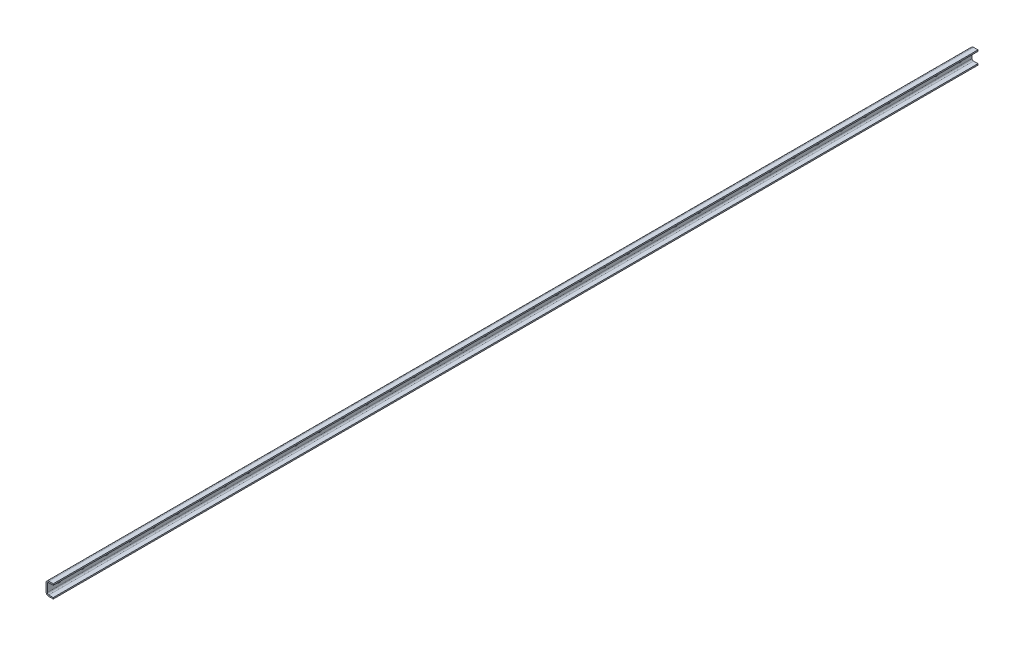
from build123d import *

# Parameters (mm, degrees)
EXTRUDE1_DEPTH  = 3120
EXTRUDE2_DEPTH  = 3121.144509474
LPATTERN1_COUNT = 39
LPATTERN1_PITCH = 80


with BuildPart() as part:
    # Sketch1 → Extrude1 (new body)
    with BuildSketch(Plane.XY):
        with BuildLine():
            Line((24.5, 17.9), (24.5, 22.4))
            Line((24.5, 22.4), (9.5, 22.4))
            ThreePointArc((9.5, 22.4), (2.782485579, 19.617514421), (0, 12.9))
            Line((0, 12.9), (0, -12.9))
            ThreePointArc((0, -12.9), (2.782485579, -19.617514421), (9.5, -22.4))
            Line((9.5, -22.4), (24.5, -22.4))
            Line((24.5, -22.4), (24.5, -17.9))
            Line((24.5, -17.9), (9.5, -17.9))
            ThreePointArc((9.5, -17.9), (5.964466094, -16.435533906), (4.5, -12.9))
            Line((4.5, -12.9), (4.5, 12.9))
            ThreePointArc((4.5, 12.9), (5.964466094, 16.435533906), (9.5, 17.9))
            Line((9.5, 17.9), (24.5, 17.9))
        make_face()
    extrude(amount=-EXTRUDE1_DEPTH)

    # Sketch2 → Extrude2 (cut, through all)
    with BuildSketch(Plane(origin=(4.5, 0, 0), x_dir=(0, 0, -1), z_dir=(1, 0, 0))):
        with BuildLine():
            Line((39, 4.5), (41, 4.5))
            ThreePointArc((41, 4.5), (45.5, 0), (41, -4.5))
            Line((41, -4.5), (39, -4.5))
            ThreePointArc((39, -4.5), (34.5, 0), (39, 4.5))
        make_face()
    extrude2 = extrude(amount=-EXTRUDE2_DEPTH, mode=Mode.SUBTRACT)

    # LPattern1: Extrude2 ×39
    with Locations(*[(0, 0, -i * LPATTERN1_PITCH) for i in range(1, LPATTERN1_COUNT)]):
        add(extrude2, mode=Mode.SUBTRACT)


solid = part.part
